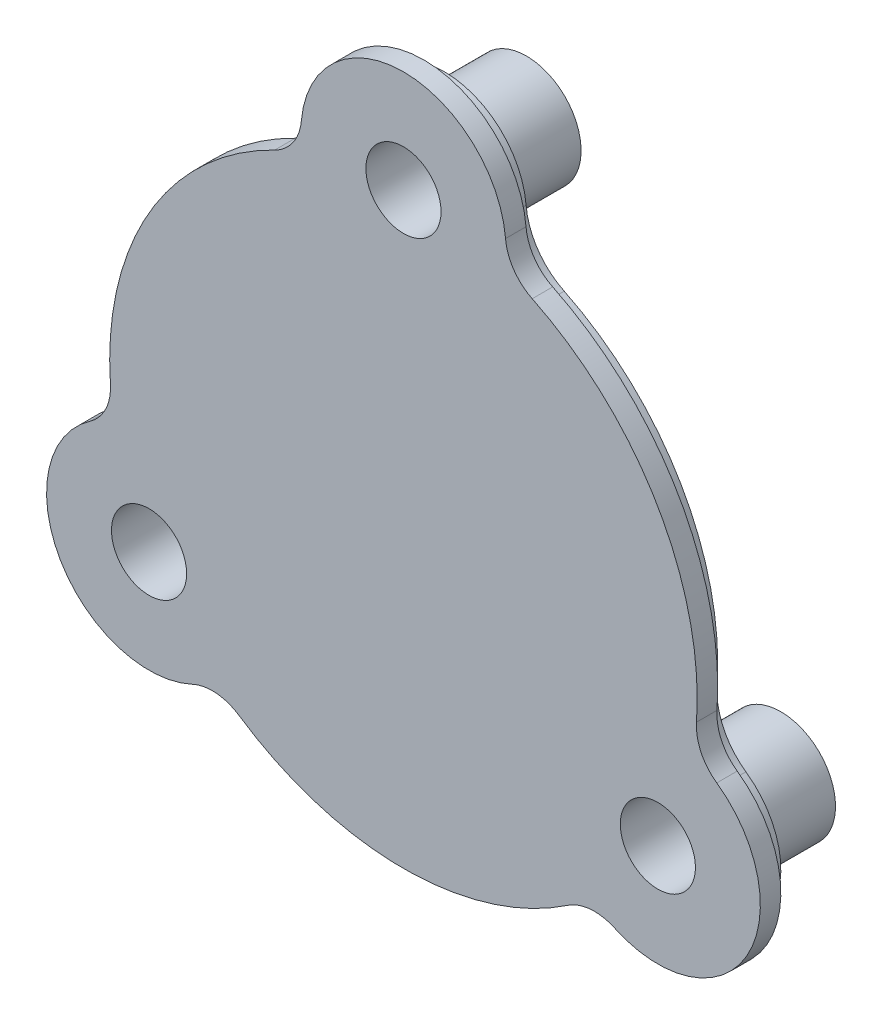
from build123d import *

# Parameters (mm, degrees)
BOSS_EXTRUDE1_DEPTH = 3
BOSS_EXTRUDE2_DEPTH = 3
SKETCH3_R           = 8
SKETCH3_R_2         = 3
BOSS_EXTRUDE3_DEPTH = 12
SKETCH4_R           = 5.5
CUT_EXTRUDE1_DEPTH  = 12


with BuildPart() as part:
    # Sketch1 → Boss-Extrude1 (new body)
    with BuildSketch(Plane.XY):
        with BuildLine():
            ThreePointArc((42.894958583, -3.003752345), (37.239092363, 21.5), (18.846153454, 38.65))
            ThreePointArc((18.846153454, 38.65), (16.147655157, 40.973517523), (14.941453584, 44.323995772))
            ThreePointArc((14.941453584, 44.323995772), (0, 58), (-14.941453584, 44.323995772))
            ThreePointArc((-14.941453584, 44.323995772), (-16.147655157, 40.973517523), (-18.846153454, 38.65))
            ThreePointArc((-18.846153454, 38.65), (-37.239092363, 21.5), (-42.894958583, -3.003752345))
            ThreePointArc((-42.894958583, -3.003752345), (-43.557934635, -6.502479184), (-45.856433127, -9.222319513))
            ThreePointArc((-45.856433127, -9.222319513), (-50.229473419, -29), (-30.914979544, -35.101676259))
            ThreePointArc((-30.914979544, -35.101676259), (-27.410279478, -34.471038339), (-24.048805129, -35.646247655))
            ThreePointArc((-24.048805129, -35.646247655), (0, -43), (24.048805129, -35.646247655))
            ThreePointArc((24.048805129, -35.646247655), (27.410279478, -34.471038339), (30.914979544, -35.101676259))
            ThreePointArc((30.914979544, -35.101676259), (50.229473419, -29), (45.856433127, -9.222319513))
            ThreePointArc((45.856433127, -9.222319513), (43.557934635, -6.502479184), (42.894958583, -3.003752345))
        make_face()
    extrude(amount=-BOSS_EXTRUDE1_DEPTH)

    # Sketch2 → Boss-Extrude2 (add)
    with BuildSketch(Plane(origin=(0, 0, -3), x_dir=(-1, 0, 0), z_dir=(0, 0, -1))):
        with BuildLine():
            ThreePointArc((11.953162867, 44.059196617), (13.676307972, 39.272799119), (17.531305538, 35.953488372))
            ThreePointArc((17.531305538, 35.953488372), (34.641016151, 20), (39.902287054, -2.794188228))
            ThreePointArc((39.902287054, -2.794188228), (40.8493957, -7.792369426), (44.132964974, -11.67785561))
            ThreePointArc((44.132964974, -11.67785561), (47.631397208, -27.5), (32.179802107, -32.381341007))
            ThreePointArc((32.179802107, -32.381341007), (27.173087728, -31.480429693), (22.370981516, -33.159300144))
            ThreePointArc((22.370981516, -33.159300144), (0, -40), (-22.370981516, -33.159300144))
            ThreePointArc((-22.370981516, -33.159300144), (-27.173087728, -31.480429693), (-32.179802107, -32.381341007))
            ThreePointArc((-32.179802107, -32.381341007), (-47.631397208, -27.5), (-44.132964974, -11.67785561))
            ThreePointArc((-44.132964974, -11.67785561), (-40.8493957, -7.792369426), (-39.902287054, -2.794188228))
            ThreePointArc((-39.902287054, -2.794188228), (-34.641016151, 20), (-17.531305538, 35.953488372))
            ThreePointArc((-17.531305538, 35.953488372), (-13.676307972, 39.272799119), (-11.953162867, 44.059196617))
            ThreePointArc((-11.953162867, 44.059196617), (0, 55), (11.953162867, 44.059196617))
        make_face()
    extrude(amount=BOSS_EXTRUDE2_DEPTH)

    # Sketch3 → Boss-Extrude3 (add)
    # profile 1 of 3: a face of its own
    with BuildSketch(Plane(origin=(0, 0, -6), x_dir=(-1, 0, 0), z_dir=(0, 0, -1))):
        with Locations((0, 43)):
            Circle(SKETCH3_R)
        with Locations((0, 43)):
            Circle(SKETCH3_R_2, mode=Mode.SUBTRACT)
    # profile 2 of 3: a face of its own
    with BuildSketch(Plane(origin=(0, 0, -6), x_dir=(-1, 0, 0), z_dir=(0, 0, -1))):
        with Locations((37.239092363, -21.5)):
            Circle(SKETCH3_R)
        with Locations((37.239092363, -21.5)):
            Circle(SKETCH3_R_2, mode=Mode.SUBTRACT)
    # profile 3 of 3: a face of its own
    with BuildSketch(Plane(origin=(0, 0, -6), x_dir=(-1, 0, 0), z_dir=(0, 0, -1))):
        with Locations((-37.239092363, -21.5)):
            Circle(SKETCH3_R)
        with Locations((-37.239092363, -21.5)):
            Circle(SKETCH3_R_2, mode=Mode.SUBTRACT)
    extrude(amount=BOSS_EXTRUDE3_DEPTH)

    # Sketch4 → Cut-Extrude1 (cut)
    with BuildSketch(Plane.XY):
        with Locations((0, 43)):
            Circle(SKETCH4_R)
        with Locations((37.239092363, -21.5)):
            Circle(SKETCH4_R)
        with Locations((-37.239092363, -21.5)):
            Circle(SKETCH4_R)
    extrude(amount=-CUT_EXTRUDE1_DEPTH, mode=Mode.SUBTRACT)


solid = part.part
